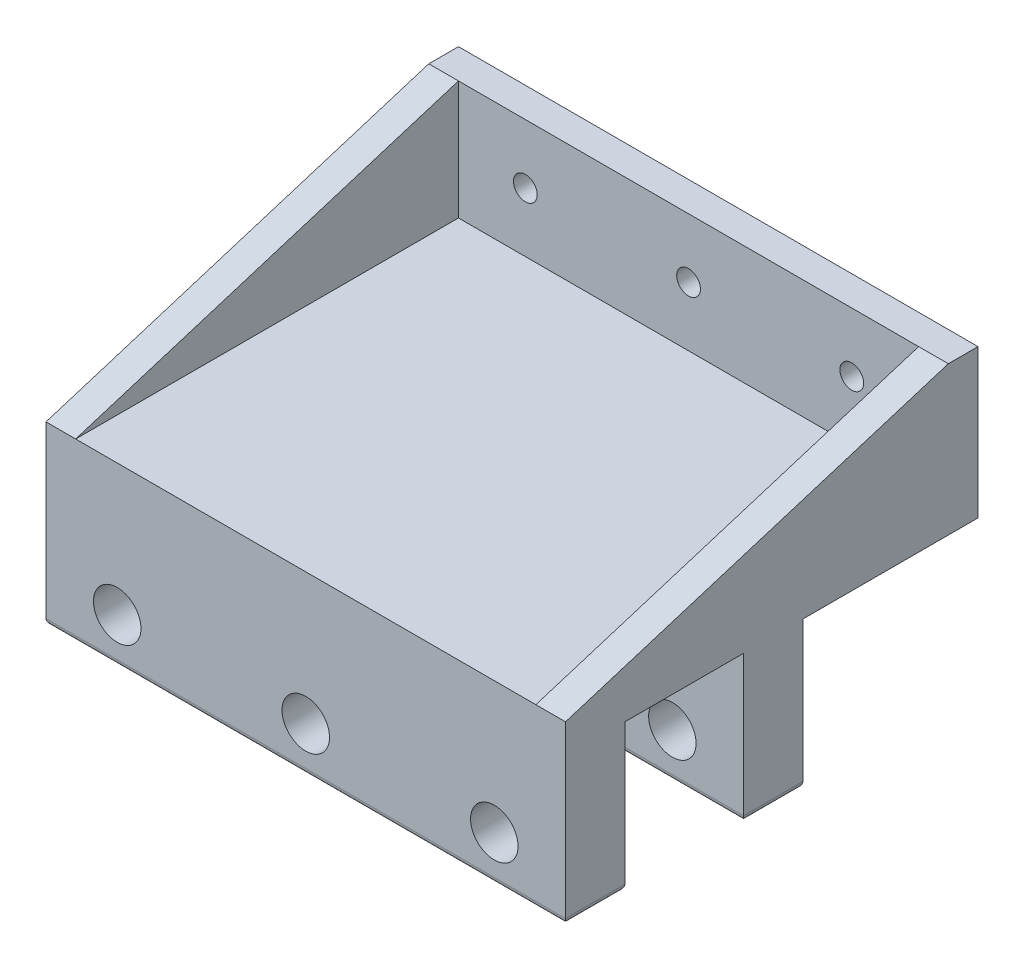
from build123d import *
from build123d.topology import SkipClean

# Parameters (mm, degrees)
SKETCH1_R           = 4
BOSS_EXTRUDE1_DEPTH = 5
SKETCH3_W           = 87.53850131
SKETCH3_H           = 5
BOSS_EXTRUDE2_DEPTH = 64.5
SKETCH5_W           = 87.53850131
SKETCH5_H           = 20
BOSS_EXTRUDE3_DEPTH = 5
SKETCH6_W           = 87.53850131
SKETCH6_H           = 10
BOSS_EXTRUDE4_DEPTH = 24.704151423
SKETCH7_R           = 4
CUT_EXTRUDE1_DEPTH  = 109.156905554
SKETCH8_W           = 5
SKETCH8_H           = 20
BOSS_EXTRUDE5_DEPTH = 64.5
CUT_EXTRUDE3_DEPTH  = 117.623604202
CUT_EXTRUDE4_DEPTH  = 120.573894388
SKETCH13_W          = 87.53850131
SKETCH13_H          = 5
BOSS_EXTRUDE6_DEPTH = 24.704151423
SKETCH14_R          = 4
CUT_EXTRUDE6_DEPTH  = 117.952623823
FILLET2_R           = 1


with BuildPart() as part:
    # Sketch1 → Boss-Extrude1 (new body)
    with BuildSketch(Plane.XY):
        Polygon((15.893661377, -7.539879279), (79.432162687, -7.539879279), (91.432162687, -7.539879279), (91.432162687, 22.164272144), (3.893661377, 22.164272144), (3.893661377, -7.539879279), align=None)
        with Locations((15.893661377, 0)):
            Circle(SKETCH1_R, mode=Mode.SUBTRACT)
        with Locations((47.662912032, 0)):
            Circle(SKETCH1_R, mode=Mode.SUBTRACT)
        with Locations((79.432162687, 0)):
            Circle(SKETCH1_R, mode=Mode.SUBTRACT)
    extrude(amount=BOSS_EXTRUDE1_DEPTH)

    # Sketch3 → Boss-Extrude2 (add)
    with BuildSketch(Plane(origin=(0, 0, 0), x_dir=(-1, 0, 0), z_dir=(0, 0, -1))):
        with Locations((-47.662912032, 19.664272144)):
            Rectangle(SKETCH3_W, SKETCH3_H)
    extrude(amount=BOSS_EXTRUDE2_DEPTH)

    # Sketch5 → Boss-Extrude3 (add)
    with BuildSketch(Plane(origin=(0, 0, -64.5), x_dir=(-1, 0, 0), z_dir=(0, 0, -1))):
        with Locations((-47.662912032, 32.164272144)):
            Rectangle(SKETCH5_W, SKETCH5_H)
    extrude(amount=-BOSS_EXTRUDE3_DEPTH)

    # Sketch6 → Boss-Extrude4 (add)
    with BuildSketch(Plane.XZ.offset(-17.164272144)):
        with Locations((47.662912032, -30)):
            Rectangle(SKETCH6_W, SKETCH6_H)
    extrude(amount=BOSS_EXTRUDE4_DEPTH)

    # Sketch7 → Cut-Extrude1 (cut, through all)
    with BuildSketch(Plane.XY.offset(-25)):
        with Locations((79.432162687, 0)):
            Circle(SKETCH7_R)
        with Locations((47.662912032, 0)):
            Circle(SKETCH7_R)
        with Locations((15.893661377, 0)):
            Circle(SKETCH7_R)
    extrude(amount=-CUT_EXTRUDE1_DEPTH, mode=Mode.SUBTRACT)

    # Sketch8 → Boss-Extrude5 (add)
    with BuildSketch(Plane.XY.offset(-59.5)):
        with Locations((6.393661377, 32.164272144)):
            Rectangle(SKETCH8_W, SKETCH8_H)
        with Locations((88.932162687, 32.164272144)):
            Rectangle(SKETCH8_W, SKETCH8_H)
    extrude(amount=BOSS_EXTRUDE5_DEPTH)

    # Sketch9 → Cut-Extrude3 (cut, through all)
    with BuildSketch(Plane(origin=(91.432162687, 0, 0), x_dir=(0, 0, -1), z_dir=(1, 0, 0))):
        Polygon((-5, 42.164272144), (-5, 22.164272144), (59.5, 42.164272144), align=None)
    extrude(amount=-CUT_EXTRUDE3_DEPTH, mode=Mode.SUBTRACT)

    # Sketch10 → Cut-Extrude4 (cut, through all)
    with BuildSketch(Plane.XY.offset(-59.5)):
        with BuildLine():
            Line((18.162912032, 32.164272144), (20.162912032, 32.164272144))
            Line((20.162912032, 32.164272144), (22.162912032, 32.164272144))
            ThreePointArc((22.162912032, 32.164272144), (20.162912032, 34.164272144), (18.162912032, 32.164272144))
        make_face()
        with BuildLine():
            Line((22.162912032, 32.164272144), (20.162912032, 32.164272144))
            Line((20.162912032, 32.164272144), (18.162912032, 32.164272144))
            ThreePointArc((18.162912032, 32.164272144), (20.162912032, 30.164272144), (22.162912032, 32.164272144))
        make_face()
        with BuildLine():
            Line((18.162912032, 32.164272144), (20.162912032, 32.164272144))
            Line((20.162912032, 32.164272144), (22.162912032, 32.164272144))
            ThreePointArc((22.162912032, 32.164272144), (20.162912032, 34.164272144), (18.162912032, 32.164272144))
        make_face()
        with BuildLine():
            Line((22.162912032, 32.164272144), (20.162912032, 32.164272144))
            Line((20.162912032, 32.164272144), (18.162912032, 32.164272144))
            ThreePointArc((18.162912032, 32.164272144), (20.162912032, 30.164272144), (22.162912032, 32.164272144))
        make_face()
        with BuildLine():
            ThreePointArc((49.662912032, 32.164272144), (47.662912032, 34.164272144), (45.662912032, 32.164272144))
            Line((45.662912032, 32.164272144), (49.662912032, 32.164272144))
        make_face()
        with BuildLine():
            Line((49.662912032, 32.164272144), (45.662912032, 32.164272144))
            ThreePointArc((45.662912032, 32.164272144), (47.662912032, 30.164272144), (49.662912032, 32.164272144))
        make_face()
        with BuildLine():
            ThreePointArc((49.662912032, 32.164272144), (47.662912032, 34.164272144), (45.662912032, 32.164272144))
            Line((45.662912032, 32.164272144), (49.662912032, 32.164272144))
        make_face()
        with BuildLine():
            Line((49.662912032, 32.164272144), (45.662912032, 32.164272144))
            ThreePointArc((45.662912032, 32.164272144), (47.662912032, 30.164272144), (49.662912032, 32.164272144))
        make_face()
        with BuildLine():
            ThreePointArc((77.162912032, 32.164272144), (75.162912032, 34.164272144), (73.162912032, 32.164272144))
            Line((73.162912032, 32.164272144), (75.162912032, 32.164272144))
            Line((75.162912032, 32.164272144), (77.162912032, 32.164272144))
        make_face()
        with BuildLine():
            Line((75.162912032, 32.164272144), (73.162912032, 32.164272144))
            ThreePointArc((73.162912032, 32.164272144), (75.162912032, 30.164272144), (77.162912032, 32.164272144))
            Line((77.162912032, 32.164272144), (75.162912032, 32.164272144))
        make_face()
        with BuildLine():
            ThreePointArc((77.162912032, 32.164272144), (75.162912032, 34.164272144), (73.162912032, 32.164272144))
            Line((73.162912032, 32.164272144), (75.162912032, 32.164272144))
            Line((75.162912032, 32.164272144), (77.162912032, 32.164272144))
        make_face()
        with BuildLine():
            Line((75.162912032, 32.164272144), (73.162912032, 32.164272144))
            ThreePointArc((73.162912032, 32.164272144), (75.162912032, 30.164272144), (77.162912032, 32.164272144))
            Line((77.162912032, 32.164272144), (75.162912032, 32.164272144))
        make_face()
    extrude(amount=-CUT_EXTRUDE4_DEPTH, mode=Mode.SUBTRACT)

    # Sketch13 → Boss-Extrude6 (add)
    with BuildSketch(Plane.XZ.offset(-17.164272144)):
        with Locations((47.662912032, -2.5)):
            Rectangle(SKETCH13_W, SKETCH13_H)
    extrude(amount=BOSS_EXTRUDE6_DEPTH)

    # Sketch14 → Cut-Extrude6 (cut, through all)
    with SkipClean():  # the faces are left unmerged after this step: merging them gives an invalid solid
        with BuildSketch(Plane(origin=(0, 0, -5), x_dir=(-1, 0, 0), z_dir=(0, 0, -1))):
            with Locations((-79.432162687, 0)):
                Circle(SKETCH14_R)
            with Locations((-15.893661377, 0)):
                Circle(SKETCH14_R)
            with Locations((-47.662912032, 0)):
                Circle(SKETCH14_R)
        extrude(amount=-CUT_EXTRUDE6_DEPTH, mode=Mode.SUBTRACT)

    # Fillet2
    fillet2_edges = [part.edges().sort_by_distance(p)[0] for p in [
        (47.662912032, -7.539879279, -5),
        (91.432162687, -7.539879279, 2.5),
        (3.893661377, -7.539879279, 0),
        (47.662912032, -7.539879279, 5),
        (3.893661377, -7.539879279, -30),
        (91.432162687, -7.539879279, -30),
        (47.662912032, -7.539879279, -35),
        (47.662912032, -7.539879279, -25),
    ]]
    fillet(fillet2_edges, radius=FILLET2_R)


solid = part.part
